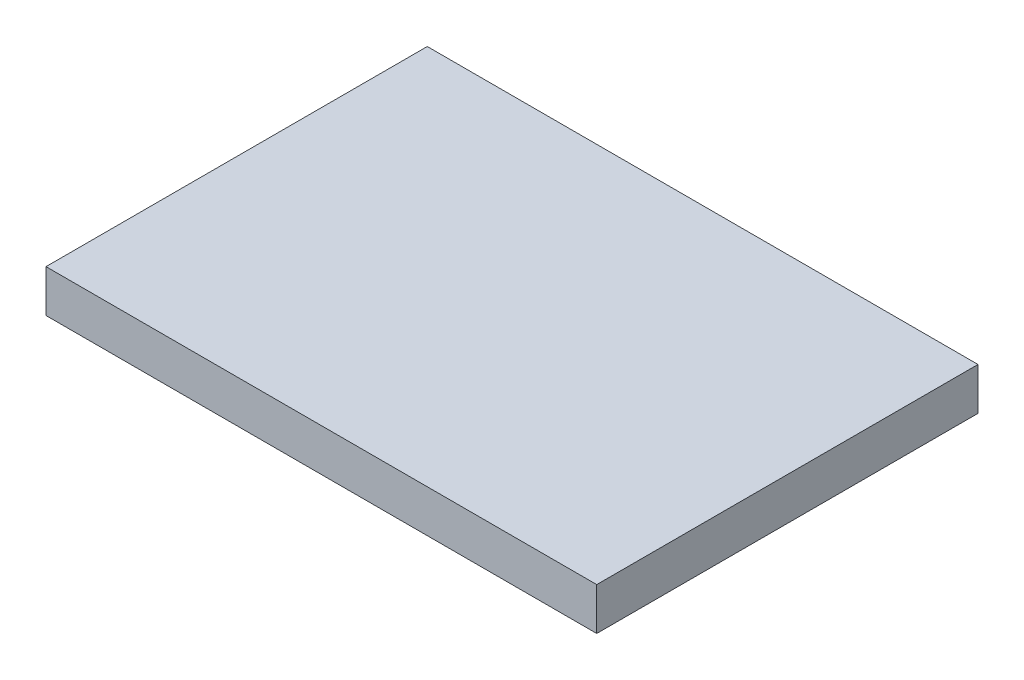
ISO-10303-21;
HEADER;
FILE_DESCRIPTION(('STEP AP214'),'2;1');
FILE_NAME('part.step','',(''),(''),'','','');
FILE_SCHEMA(('AUTOMOTIVE_DESIGN { 1 0 10303 214 1 1 1 1 }'));
ENDSEC;
DATA;
#1=APPLICATION_CONTEXT('core data for automotive mechanical design processes');
#2=APPLICATION_PROTOCOL_DEFINITION('international standard','automotive_design',2000,#1);
#3=PRODUCT_CONTEXT('',#1,'mechanical');
#4=PRODUCT('Part','Part','',(#3));
#5=PRODUCT_RELATED_PRODUCT_CATEGORY('part','',(#4));
#6=PRODUCT_DEFINITION_FORMATION('','',#4);
#7=PRODUCT_DEFINITION_CONTEXT('part definition',#1,'design');
#8=PRODUCT_DEFINITION('design','',#6,#7);
#9=PRODUCT_DEFINITION_SHAPE('','',#8);
#10=(LENGTH_UNIT() NAMED_UNIT(*) SI_UNIT(.MILLI.,.METRE.));
#11=(NAMED_UNIT(*) PLANE_ANGLE_UNIT() SI_UNIT($,.RADIAN.));
#12=(NAMED_UNIT(*) SI_UNIT($,.STERADIAN.) SOLID_ANGLE_UNIT());
#13=UNCERTAINTY_MEASURE_WITH_UNIT(LENGTH_MEASURE(1.E-05),#10,'distance_accuracy_value','');
#14=(GEOMETRIC_REPRESENTATION_CONTEXT(3) GLOBAL_UNCERTAINTY_ASSIGNED_CONTEXT((#13)) GLOBAL_UNIT_ASSIGNED_CONTEXT((#10,
#11,#12)) REPRESENTATION_CONTEXT('',''));
#15=CARTESIAN_POINT('',(0.,0.,0.));
#16=DIRECTION('',(0.,0.,1.));
#17=DIRECTION('',(1.,0.,0.));
#18=AXIS2_PLACEMENT_3D('',#15,#16,#17);
#19=CARTESIAN_POINT('',(208.471816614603,44.989217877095,225.));
#20=DIRECTION('',(-1.,0.,0.));
#21=DIRECTION('',(0.,0.,1.));
#22=AXIS2_PLACEMENT_3D('',#19,#20,#21);
#23=PLANE('',#22);
#24=DIRECTION('',(0.,1.,0.));
#25=VECTOR('',#24,1.);
#26=CARTESIAN_POINT('',(208.471816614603,44.989217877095,0.));
#27=LINE('',#26,#25);
#28=CARTESIAN_POINT('',(208.471816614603,44.989217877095,0.));
#29=VERTEX_POINT('',#28);
#30=CARTESIAN_POINT('',(208.471816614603,69.989217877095,0.));
#31=VERTEX_POINT('',#30);
#32=EDGE_CURVE('E95',#29,#31,#27,.T.);
#33=ORIENTED_EDGE('',*,*,#32,.T.);
#34=DIRECTION('',(0.,0.,-1.));
#35=VECTOR('',#34,1.);
#36=CARTESIAN_POINT('',(208.471816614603,69.989217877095,225.));
#37=LINE('',#36,#35);
#38=CARTESIAN_POINT('',(208.471816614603,69.989217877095,225.));
#39=VERTEX_POINT('',#38);
#40=EDGE_CURVE('E11',#39,#31,#37,.T.);
#41=ORIENTED_EDGE('',*,*,#40,.F.);
#42=DIRECTION('',(0.,1.,0.));
#43=VECTOR('',#42,1.);
#44=CARTESIAN_POINT('',(208.471816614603,44.989217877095,225.));
#45=LINE('',#44,#43);
#46=CARTESIAN_POINT('',(208.471816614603,44.989217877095,225.));
#47=VERTEX_POINT('',#46);
#48=EDGE_CURVE('E83',#47,#39,#45,.T.);
#49=ORIENTED_EDGE('',*,*,#48,.F.);
#50=DIRECTION('',(0.,0.,-1.));
#51=VECTOR('',#50,1.);
#52=CARTESIAN_POINT('',(208.471816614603,44.989217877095,225.));
#53=LINE('',#52,#51);
#54=EDGE_CURVE('E91',#47,#29,#53,.T.);
#55=ORIENTED_EDGE('',*,*,#54,.T.);
#56=EDGE_LOOP('',(#33,#41,#49,#55));
#57=FACE_BOUND('',#56,.T.);
#58=ADVANCED_FACE('F32',(#57),#23,.F.);
#59=CARTESIAN_POINT('',(208.471816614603,69.989217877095,225.));
#60=DIRECTION('',(0.,-1.,0.));
#61=DIRECTION('',(1.,0.,0.));
#62=AXIS2_PLACEMENT_3D('',#59,#60,#61);
#63=PLANE('',#62);
#64=DIRECTION('',(-1.,0.,0.));
#65=VECTOR('',#64,1.);
#66=CARTESIAN_POINT('',(208.471816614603,69.989217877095,0.));
#67=LINE('',#66,#65);
#68=CARTESIAN_POINT('',(-116.528183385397,69.989217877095,0.));
#69=VERTEX_POINT('',#68);
#70=EDGE_CURVE('E87',#31,#69,#67,.T.);
#71=ORIENTED_EDGE('',*,*,#70,.T.);
#72=DIRECTION('',(0.,0.,-1.));
#73=VECTOR('',#72,1.);
#74=CARTESIAN_POINT('',(-116.528183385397,69.989217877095,225.));
#75=LINE('',#74,#73);
#76=CARTESIAN_POINT('',(-116.528183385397,69.989217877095,225.));
#77=VERTEX_POINT('',#76);
#78=EDGE_CURVE('E40',#77,#69,#75,.T.);
#79=ORIENTED_EDGE('',*,*,#78,.F.);
#80=DIRECTION('',(-1.,0.,0.));
#81=VECTOR('',#80,1.);
#82=CARTESIAN_POINT('',(208.471816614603,69.989217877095,225.));
#83=LINE('',#82,#81);
#84=EDGE_CURVE('E78',#39,#77,#83,.T.);
#85=ORIENTED_EDGE('',*,*,#84,.F.);
#86=ORIENTED_EDGE('',*,*,#40,.T.);
#87=EDGE_LOOP('',(#71,#79,#85,#86));
#88=FACE_BOUND('',#87,.T.);
#89=ADVANCED_FACE('F86',(#88),#63,.F.);
#90=CARTESIAN_POINT('',(-116.528183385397,44.989217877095,225.));
#91=DIRECTION('',(1.,0.,0.));
#92=DIRECTION('',(0.,0.,-1.));
#93=AXIS2_PLACEMENT_3D('',#90,#91,#92);
#94=PLANE('',#93);
#95=DIRECTION('',(0.,-1.,0.));
#96=VECTOR('',#95,1.);
#97=CARTESIAN_POINT('',(-116.528183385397,44.989217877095,0.));
#98=LINE('',#97,#96);
#99=CARTESIAN_POINT('',(-116.528183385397,44.989217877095,0.));
#100=VERTEX_POINT('',#99);
#101=EDGE_CURVE('E65',#69,#100,#98,.T.);
#102=ORIENTED_EDGE('',*,*,#101,.T.);
#103=DIRECTION('',(0.,0.,-1.));
#104=VECTOR('',#103,1.);
#105=CARTESIAN_POINT('',(-116.528183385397,44.989217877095,225.));
#106=LINE('',#105,#104);
#107=CARTESIAN_POINT('',(-116.528183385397,44.989217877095,225.));
#108=VERTEX_POINT('',#107);
#109=EDGE_CURVE('E88',#108,#100,#106,.T.);
#110=ORIENTED_EDGE('',*,*,#109,.F.);
#111=DIRECTION('',(0.,-1.,0.));
#112=VECTOR('',#111,1.);
#113=CARTESIAN_POINT('',(-116.528183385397,44.989217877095,225.));
#114=LINE('',#113,#112);
#115=EDGE_CURVE('E81',#77,#108,#114,.T.);
#116=ORIENTED_EDGE('',*,*,#115,.F.);
#117=ORIENTED_EDGE('',*,*,#78,.T.);
#118=EDGE_LOOP('',(#102,#110,#116,#117));
#119=FACE_BOUND('',#118,.T.);
#120=ADVANCED_FACE('F89',(#119),#94,.F.);
#121=CARTESIAN_POINT('',(208.471816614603,44.989217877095,225.));
#122=DIRECTION('',(0.,1.,0.));
#123=DIRECTION('',(-1.,0.,0.));
#124=AXIS2_PLACEMENT_3D('',#121,#122,#123);
#125=PLANE('',#124);
#126=DIRECTION('',(1.,0.,0.));
#127=VECTOR('',#126,1.);
#128=CARTESIAN_POINT('',(208.471816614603,44.989217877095,0.));
#129=LINE('',#128,#127);
#130=EDGE_CURVE('E71',#100,#29,#129,.T.);
#131=ORIENTED_EDGE('',*,*,#130,.T.);
#132=ORIENTED_EDGE('',*,*,#54,.F.);
#133=DIRECTION('',(1.,0.,0.));
#134=VECTOR('',#133,1.);
#135=CARTESIAN_POINT('',(208.471816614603,44.989217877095,225.));
#136=LINE('',#135,#134);
#137=EDGE_CURVE('E48',#108,#47,#136,.T.);
#138=ORIENTED_EDGE('',*,*,#137,.F.);
#139=ORIENTED_EDGE('',*,*,#109,.T.);
#140=EDGE_LOOP('',(#131,#132,#138,#139));
#141=FACE_BOUND('',#140,.T.);
#142=ADVANCED_FACE('F102',(#141),#125,.F.);
#143=CARTESIAN_POINT('',(208.471816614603,69.989217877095,225.));
#144=DIRECTION('',(0.,0.,1.));
#145=DIRECTION('',(1.,0.,0.));
#146=AXIS2_PLACEMENT_3D('',#143,#144,#145);
#147=PLANE('',#146);
#148=ORIENTED_EDGE('',*,*,#48,.T.);
#149=ORIENTED_EDGE('',*,*,#84,.T.);
#150=ORIENTED_EDGE('',*,*,#115,.T.);
#151=ORIENTED_EDGE('',*,*,#137,.T.);
#152=EDGE_LOOP('',(#148,#149,#150,#151));
#153=FACE_BOUND('',#152,.T.);
#154=ADVANCED_FACE('F79',(#153),#147,.T.);
#155=CARTESIAN_POINT('',(208.471816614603,69.989217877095,0.));
#156=DIRECTION('',(0.,0.,1.));
#157=DIRECTION('',(1.,0.,0.));
#158=AXIS2_PLACEMENT_3D('',#155,#156,#157);
#159=PLANE('',#158);
#160=ORIENTED_EDGE('',*,*,#32,.F.);
#161=ORIENTED_EDGE('',*,*,#130,.F.);
#162=ORIENTED_EDGE('',*,*,#101,.F.);
#163=ORIENTED_EDGE('',*,*,#70,.F.);
#164=EDGE_LOOP('',(#160,#161,#162,#163));
#165=FACE_BOUND('',#164,.T.);
#166=ADVANCED_FACE('F105',(#165),#159,.F.);
#167=CLOSED_SHELL('',(#58,#89,#120,#142,#154,#166));
#168=MANIFOLD_SOLID_BREP('B2',#167);
#169=ADVANCED_BREP_SHAPE_REPRESENTATION('',(#18,#168),#14);
#170=SHAPE_DEFINITION_REPRESENTATION(#9,#169);
ENDSEC;
END-ISO-10303-21;
